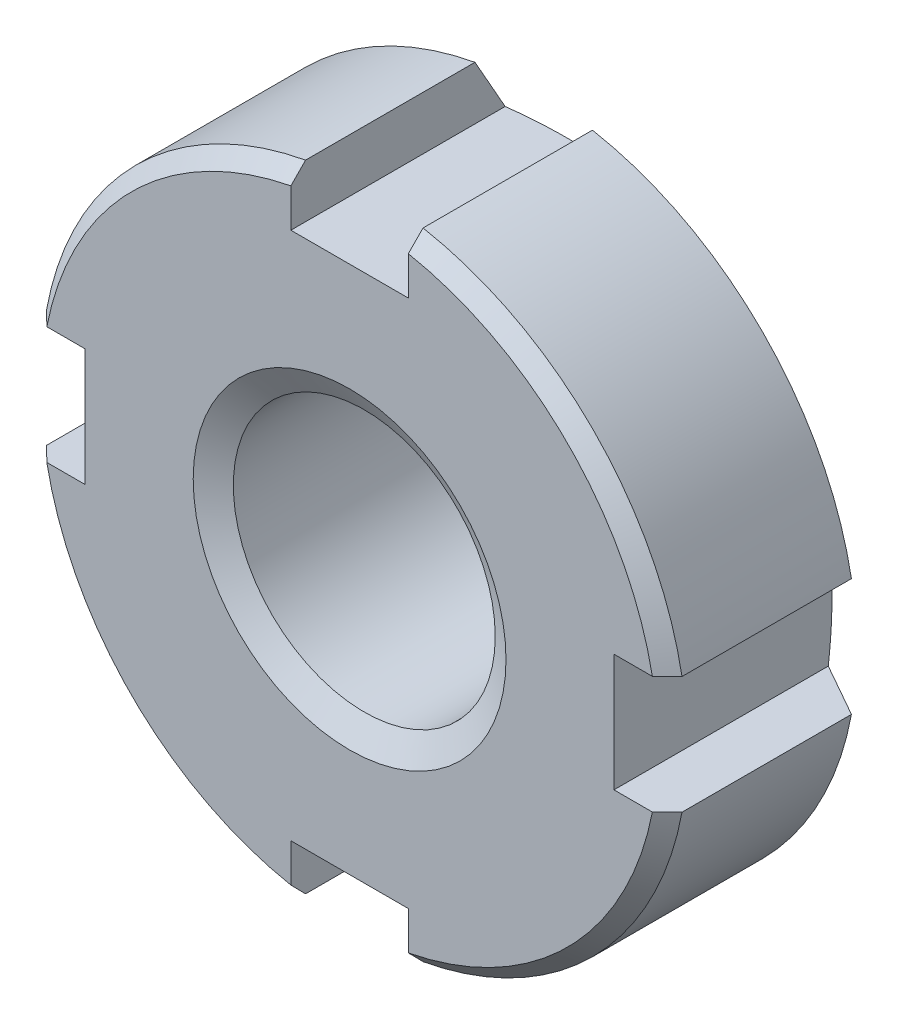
ISO-10303-21;
HEADER;
FILE_DESCRIPTION(('STEP AP214'),'2;1');
FILE_NAME('part.step','',(''),(''),'','','');
FILE_SCHEMA(('AUTOMOTIVE_DESIGN { 1 0 10303 214 1 1 1 1 }'));
ENDSEC;
DATA;
#1=APPLICATION_CONTEXT('core data for automotive mechanical design processes');
#2=APPLICATION_PROTOCOL_DEFINITION('international standard','automotive_design',2000,#1);
#3=PRODUCT_CONTEXT('',#1,'mechanical');
#4=PRODUCT('Part','Part','',(#3));
#5=PRODUCT_RELATED_PRODUCT_CATEGORY('part','',(#4));
#6=PRODUCT_DEFINITION_FORMATION('','',#4);
#7=PRODUCT_DEFINITION_CONTEXT('part definition',#1,'design');
#8=PRODUCT_DEFINITION('design','',#6,#7);
#9=PRODUCT_DEFINITION_SHAPE('','',#8);
#10=(LENGTH_UNIT() NAMED_UNIT(*) SI_UNIT(.MILLI.,.METRE.));
#11=(NAMED_UNIT(*) PLANE_ANGLE_UNIT() SI_UNIT($,.RADIAN.));
#12=(NAMED_UNIT(*) SI_UNIT($,.STERADIAN.) SOLID_ANGLE_UNIT());
#13=UNCERTAINTY_MEASURE_WITH_UNIT(LENGTH_MEASURE(1.E-05),#10,'distance_accuracy_value','');
#14=(GEOMETRIC_REPRESENTATION_CONTEXT(3) GLOBAL_UNCERTAINTY_ASSIGNED_CONTEXT((#13)) GLOBAL_UNIT_ASSIGNED_CONTEXT((#10,
#11,#12)) REPRESENTATION_CONTEXT('',''));
#15=CARTESIAN_POINT('',(0.,0.,0.));
#16=DIRECTION('',(0.,0.,1.));
#17=DIRECTION('',(1.,0.,0.));
#18=AXIS2_PLACEMENT_3D('',#15,#16,#17);
#19=CARTESIAN_POINT('',(0.,0.,-8.));
#20=DIRECTION('',(0.,0.,1.));
#21=DIRECTION('',(1.,0.,0.));
#22=AXIS2_PLACEMENT_3D('',#19,#20,#21);
#23=CYLINDRICAL_SURFACE('',#22,11.);
#24=DIRECTION('',(0.,0.,-1.));
#25=VECTOR('',#24,1.);
#26=CARTESIAN_POINT('',(-10.8166538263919,-2.00000000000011,0.));
#27=LINE('',#26,#25);
#28=CARTESIAN_POINT('',(-10.8166538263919,-2.00000000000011,-0.499999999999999));
#29=VERTEX_POINT('',#28);
#30=CARTESIAN_POINT('',(-10.8166538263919,-2.00000000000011,-6.26794919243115));
#31=VERTEX_POINT('',#30);
#32=EDGE_CURVE('E188',#29,#31,#27,.T.);
#33=ORIENTED_EDGE('',*,*,#32,.T.);
#34=CARTESIAN_POINT('',(0.,0.,-6.26794919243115));
#35=DIRECTION('',(0.,0.,-1.));
#36=DIRECTION('',(-1.,0.,0.));
#37=AXIS2_PLACEMENT_3D('',#34,#35,#36);
#38=CIRCLE('',#37,11.);
#39=CARTESIAN_POINT('',(-2.,-10.816653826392,-6.26794919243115));
#40=VERTEX_POINT('',#39);
#41=EDGE_CURVE('E454',#40,#31,#38,.T.);
#42=ORIENTED_EDGE('',*,*,#41,.F.);
#43=DIRECTION('',(0.,0.,-1.));
#44=VECTOR('',#43,1.);
#45=CARTESIAN_POINT('',(-2.,-10.816653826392,0.));
#46=LINE('',#45,#44);
#47=CARTESIAN_POINT('',(-2.,-10.816653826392,-0.499999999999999));
#48=VERTEX_POINT('',#47);
#49=EDGE_CURVE('E434',#48,#40,#46,.T.);
#50=ORIENTED_EDGE('',*,*,#49,.F.);
#51=CARTESIAN_POINT('',(0.,0.,-0.500000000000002));
#52=DIRECTION('',(0.,0.,1.));
#53=DIRECTION('',(1.,0.,0.));
#54=AXIS2_PLACEMENT_3D('',#51,#52,#53);
#55=CIRCLE('',#54,11.);
#56=EDGE_CURVE('E489',#48,#29,#55,.F.);
#57=ORIENTED_EDGE('',*,*,#56,.T.);
#58=EDGE_LOOP('',(#33,#42,#50,#57));
#59=FACE_BOUND('',#58,.T.);
#60=ADVANCED_FACE('F30',(#59),#23,.T.);
#61=CARTESIAN_POINT('',(0.,0.,0.));
#62=DIRECTION('',(0.,0.,-1.));
#63=DIRECTION('',(-1.,0.,0.));
#64=AXIS2_PLACEMENT_3D('',#61,#62,#63);
#65=CONICAL_SURFACE('',#64,10.5,0.785398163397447);
#66=CARTESIAN_POINT('',(-13.1380677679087,-2.00000000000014,-2.78942529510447));
#67=CARTESIAN_POINT('',(-12.7116462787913,-2.00000000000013,-2.36789004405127));
#68=CARTESIAN_POINT('',(-12.2850202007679,-2.00000000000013,-1.9465611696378));
#69=CARTESIAN_POINT('',(-11.4311341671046,-2.00000000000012,-1.10455061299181));
#70=CARTESIAN_POINT('',(-11.0038742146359,-2.00000000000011,-0.683868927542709));
#71=CARTESIAN_POINT('',(-10.148490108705,-2.0000000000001,0.156618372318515));
#72=CARTESIAN_POINT('',(-9.7203659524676,-2.0000000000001,0.576423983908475));
#73=CARTESIAN_POINT('',(-9.07722771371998,-2.00000000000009,1.20516089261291));
#74=CARTESIAN_POINT('',(-8.86268909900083,-2.00000000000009,1.41457846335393));
#75=CARTESIAN_POINT('',(-8.43321406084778,-2.00000000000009,1.83300575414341));
#76=CARTESIAN_POINT('',(-8.21827763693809,-2.00000000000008,2.04201547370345));
#77=CARTESIAN_POINT('',(-8.00310215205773,-2.00000000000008,2.25077918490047));
#78=B_SPLINE_CURVE_WITH_KNOTS('',3,(#66,#67,#68,#69,#70,#71,#72,#73,#74,#75,#76,#77),
.UNSPECIFIED.,.F.,.F.,(4,2,2,2,2,4),(0.,1.7988182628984,3.59762755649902,5.39644263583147,
6.29585464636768,7.19526773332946),.UNSPECIFIED.);
#79=CARTESIAN_POINT('',(-10.3077640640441,-2.00000000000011,0.));
#80=VERTEX_POINT('',#79);
#81=EDGE_CURVE('E211',#29,#80,#78,.T.);
#82=ORIENTED_EDGE('',*,*,#81,.F.);
#83=ORIENTED_EDGE('',*,*,#56,.F.);
#84=CARTESIAN_POINT('',(-2.,-8.00310215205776,2.25077918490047));
#85=CARTESIAN_POINT('',(-2.,-8.21827763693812,2.04201547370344));
#86=CARTESIAN_POINT('',(-2.,-8.4332140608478,1.8330057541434));
#87=CARTESIAN_POINT('',(-2.,-8.86268909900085,1.41457846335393));
#88=CARTESIAN_POINT('',(-2.,-9.07722771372,1.20516089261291));
#89=CARTESIAN_POINT('',(-2.,-9.72036595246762,0.576423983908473));
#90=CARTESIAN_POINT('',(-2.,-10.1484901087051,0.156618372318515));
#91=CARTESIAN_POINT('',(-2.,-11.003874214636,-0.683868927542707));
#92=CARTESIAN_POINT('',(-2.,-11.4311341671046,-1.1045506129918));
#93=CARTESIAN_POINT('',(-2.,-12.2850202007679,-1.9465611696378));
#94=CARTESIAN_POINT('',(-2.,-12.7116462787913,-2.36789004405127));
#95=CARTESIAN_POINT('',(-2.,-13.1380677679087,-2.78942529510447));
#96=B_SPLINE_CURVE_WITH_KNOTS('',3,(#84,#85,#86,#87,#88,#89,#90,#91,#92,#93,#94,#95),
.UNSPECIFIED.,.F.,.F.,(4,2,2,2,2,4),(0.,0.899413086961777,1.79882509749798,3.59764017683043,
5.39644947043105,7.19526773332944),.UNSPECIFIED.);
#97=CARTESIAN_POINT('',(-2.,-10.3077640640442,0.));
#98=VERTEX_POINT('',#97);
#99=EDGE_CURVE('E402',#98,#48,#96,.T.);
#100=ORIENTED_EDGE('',*,*,#99,.F.);
#101=CARTESIAN_POINT('',(0.,0.,0.));
#102=DIRECTION('',(0.,0.,1.));
#103=DIRECTION('',(1.,0.,0.));
#104=AXIS2_PLACEMENT_3D('',#101,#102,#103);
#105=CIRCLE('',#104,10.5);
#106=EDGE_CURVE('E459',#80,#98,#105,.T.);
#107=ORIENTED_EDGE('',*,*,#106,.F.);
#108=EDGE_LOOP('',(#82,#83,#100,#107));
#109=FACE_BOUND('',#108,.T.);
#110=ADVANCED_FACE('F514',(#109),#65,.T.);
#111=DIRECTION('',(0.,0.,-1.));
#112=VECTOR('',#111,1.);
#113=CARTESIAN_POINT('',(-10.816653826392,1.99999999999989,0.));
#114=LINE('',#113,#112);
#115=CARTESIAN_POINT('',(-10.816653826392,1.99999999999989,-0.499999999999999));
#116=VERTEX_POINT('',#115);
#117=CARTESIAN_POINT('',(-10.816653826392,1.99999999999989,-6.26794919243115));
#118=VERTEX_POINT('',#117);
#119=EDGE_CURVE('E50',#116,#118,#114,.T.);
#120=ORIENTED_EDGE('',*,*,#119,.F.);
#121=CARTESIAN_POINT('',(-2.00000000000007,10.816653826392,-0.499999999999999));
#122=VERTEX_POINT('',#121);
#123=EDGE_CURVE('E472',#116,#122,#55,.F.);
#124=ORIENTED_EDGE('',*,*,#123,.T.);
#125=DIRECTION('',(0.,0.,-1.));
#126=VECTOR('',#125,1.);
#127=CARTESIAN_POINT('',(-2.00000000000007,10.816653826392,0.));
#128=LINE('',#127,#126);
#129=CARTESIAN_POINT('',(-2.00000000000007,10.816653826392,-6.26794919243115));
#130=VERTEX_POINT('',#129);
#131=EDGE_CURVE('E334',#122,#130,#128,.T.);
#132=ORIENTED_EDGE('',*,*,#131,.T.);
#133=EDGE_CURVE('E455',#118,#130,#38,.T.);
#134=ORIENTED_EDGE('',*,*,#133,.F.);
#135=EDGE_LOOP('',(#120,#124,#132,#134));
#136=FACE_BOUND('',#135,.T.);
#137=ADVANCED_FACE('F470',(#136),#23,.T.);
#138=CARTESIAN_POINT('',(-8.00310215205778,1.99999999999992,2.25077918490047));
#139=CARTESIAN_POINT('',(-8.21827763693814,1.99999999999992,2.04201547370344));
#140=CARTESIAN_POINT('',(-8.43321406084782,1.99999999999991,1.8330057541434));
#141=CARTESIAN_POINT('',(-8.86268909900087,1.99999999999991,1.41457846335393));
#142=CARTESIAN_POINT('',(-9.07722771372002,1.99999999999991,1.20516089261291));
#143=CARTESIAN_POINT('',(-9.72036595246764,1.9999999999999,0.576423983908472));
#144=CARTESIAN_POINT('',(-10.1484901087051,1.9999999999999,0.156618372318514));
#145=CARTESIAN_POINT('',(-11.003874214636,1.99999999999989,-0.683868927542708));
#146=CARTESIAN_POINT('',(-11.4311341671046,1.99999999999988,-1.10455061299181));
#147=CARTESIAN_POINT('',(-12.2850202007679,1.99999999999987,-1.9465611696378));
#148=CARTESIAN_POINT('',(-12.7116462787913,1.99999999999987,-2.36789004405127));
#149=CARTESIAN_POINT('',(-13.1380677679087,1.99999999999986,-2.78942529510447));
#150=B_SPLINE_CURVE_WITH_KNOTS('',3,(#138,#139,#140,#141,#142,#143,#144,#145,#146,#147,#148,
#149),.UNSPECIFIED.,.F.,.F.,(4,2,2,2,2,4),(0.,0.899413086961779,1.79882509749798,
3.59764017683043,5.39644947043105,7.19526773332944),.UNSPECIFIED.);
#151=CARTESIAN_POINT('',(-10.3077640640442,1.99999999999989,0.));
#152=VERTEX_POINT('',#151);
#153=EDGE_CURVE('E200',#152,#116,#150,.T.);
#154=ORIENTED_EDGE('',*,*,#153,.F.);
#155=CARTESIAN_POINT('',(-2.00000000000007,10.3077640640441,0.));
#156=VERTEX_POINT('',#155);
#157=EDGE_CURVE('E195',#156,#152,#105,.T.);
#158=ORIENTED_EDGE('',*,*,#157,.F.);
#159=CARTESIAN_POINT('',(-2.00000000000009,12.9075072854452,-2.56153682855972));
#160=CARTESIAN_POINT('',(-2.00000000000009,12.4809980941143,-2.14008985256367));
#161=CARTESIAN_POINT('',(-2.00000000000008,12.0542746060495,-1.71885908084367));
#162=CARTESIAN_POINT('',(-2.00000000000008,11.2001558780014,-0.877084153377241));
#163=CARTESIAN_POINT('',(-2.00000000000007,10.7727606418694,-0.456539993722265));
#164=CARTESIAN_POINT('',(-2.00000000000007,9.91704878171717,0.383613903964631));
#165=CARTESIAN_POINT('',(-2.00000000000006,9.48873215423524,0.803223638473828));
#166=CARTESIAN_POINT('',(-2.00000000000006,8.8452332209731,1.4315922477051));
#167=CARTESIAN_POINT('',(-2.00000000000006,8.63056229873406,1.64087471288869));
#168=CARTESIAN_POINT('',(-2.00000000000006,8.20078989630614,2.05899763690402));
#169=CARTESIAN_POINT('',(-2.00000000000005,7.98568841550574,2.26783809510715));
#170=CARTESIAN_POINT('',(-2.00000000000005,7.77032714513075,2.47641078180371));
#171=B_SPLINE_CURVE_WITH_KNOTS('',3,(#159,#160,#161,#162,#163,#164,#165,#166,#167,#168,#169,
#170),.UNSPECIFIED.,.F.,.F.,(4,2,2,2,2,4),(0.,1.79881931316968,3.59762835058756,
5.39644415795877,6.295857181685,7.19527148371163),.UNSPECIFIED.);
#172=EDGE_CURVE('E332',#122,#156,#171,.T.);
#173=ORIENTED_EDGE('',*,*,#172,.F.);
#174=ORIENTED_EDGE('',*,*,#123,.F.);
#175=EDGE_LOOP('',(#154,#158,#173,#174));
#176=FACE_BOUND('',#175,.T.);
#177=ADVANCED_FACE('F520',(#176),#65,.T.);
#178=DIRECTION('',(0.,0.,-1.));
#179=VECTOR('',#178,1.);
#180=CARTESIAN_POINT('',(1.99999999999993,10.816653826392,0.));
#181=LINE('',#180,#179);
#182=CARTESIAN_POINT('',(1.99999999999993,10.816653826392,-0.499999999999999));
#183=VERTEX_POINT('',#182);
#184=CARTESIAN_POINT('',(1.99999999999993,10.816653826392,-6.26794919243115));
#185=VERTEX_POINT('',#184);
#186=EDGE_CURVE('E58',#183,#185,#181,.T.);
#187=ORIENTED_EDGE('',*,*,#186,.F.);
#188=CARTESIAN_POINT('',(10.816653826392,2.00000000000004,-0.499999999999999));
#189=VERTEX_POINT('',#188);
#190=EDGE_CURVE('E364',#183,#189,#55,.F.);
#191=ORIENTED_EDGE('',*,*,#190,.T.);
#192=DIRECTION('',(0.,0.,-1.));
#193=VECTOR('',#192,1.);
#194=CARTESIAN_POINT('',(10.816653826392,2.00000000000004,0.));
#195=LINE('',#194,#193);
#196=CARTESIAN_POINT('',(10.816653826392,2.00000000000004,-6.26794919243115));
#197=VERTEX_POINT('',#196);
#198=EDGE_CURVE('E349',#189,#197,#195,.T.);
#199=ORIENTED_EDGE('',*,*,#198,.T.);
#200=EDGE_CURVE('E362',#185,#197,#38,.T.);
#201=ORIENTED_EDGE('',*,*,#200,.F.);
#202=EDGE_LOOP('',(#187,#191,#199,#201));
#203=FACE_BOUND('',#202,.T.);
#204=ADVANCED_FACE('F361',(#203),#23,.T.);
#205=CARTESIAN_POINT('',(1.99999999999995,7.77032714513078,2.4764107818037));
#206=CARTESIAN_POINT('',(1.99999999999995,7.98568841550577,2.26783809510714));
#207=CARTESIAN_POINT('',(1.99999999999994,8.20078989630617,2.05899763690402));
#208=CARTESIAN_POINT('',(1.99999999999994,8.6305622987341,1.64087471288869));
#209=CARTESIAN_POINT('',(1.99999999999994,8.84523322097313,1.4315922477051));
#210=CARTESIAN_POINT('',(1.99999999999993,9.48873215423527,0.803223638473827));
#211=CARTESIAN_POINT('',(1.99999999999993,9.91704878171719,0.383613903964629));
#212=CARTESIAN_POINT('',(1.99999999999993,10.7727606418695,-0.456539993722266));
#213=CARTESIAN_POINT('',(1.99999999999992,11.2001558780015,-0.877084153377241));
#214=CARTESIAN_POINT('',(1.99999999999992,12.0542746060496,-1.71885908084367));
#215=CARTESIAN_POINT('',(1.99999999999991,12.4809980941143,-2.14008985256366));
#216=CARTESIAN_POINT('',(1.99999999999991,12.9075072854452,-2.56153682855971));
#217=B_SPLINE_CURVE_WITH_KNOTS('',3,(#205,#206,#207,#208,#209,#210,#211,#212,#213,#214,#215,
#216),.UNSPECIFIED.,.F.,.F.,(4,2,2,2,2,4),(0.,0.899414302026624,1.79882732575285,
3.59764313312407,5.39645217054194,7.19527148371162),.UNSPECIFIED.);
#218=CARTESIAN_POINT('',(1.99999999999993,10.3077640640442,0.));
#219=VERTEX_POINT('',#218);
#220=EDGE_CURVE('E326',#219,#183,#217,.T.);
#221=ORIENTED_EDGE('',*,*,#220,.F.);
#222=CARTESIAN_POINT('',(10.3077640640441,2.00000000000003,0.));
#223=VERTEX_POINT('',#222);
#224=EDGE_CURVE('E377',#223,#219,#105,.T.);
#225=ORIENTED_EDGE('',*,*,#224,.F.);
#226=CARTESIAN_POINT('',(12.9075072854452,2.00000000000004,-2.56153682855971));
#227=CARTESIAN_POINT('',(12.4809980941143,2.00000000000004,-2.14008985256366));
#228=CARTESIAN_POINT('',(12.0542746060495,2.00000000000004,-1.71885908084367));
#229=CARTESIAN_POINT('',(11.2001558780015,2.00000000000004,-0.877084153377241));
#230=CARTESIAN_POINT('',(10.7727606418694,2.00000000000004,-0.456539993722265));
#231=CARTESIAN_POINT('',(9.91704878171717,2.00000000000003,0.383613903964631));
#232=CARTESIAN_POINT('',(9.48873215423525,2.00000000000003,0.803223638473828));
#233=CARTESIAN_POINT('',(8.84523322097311,2.00000000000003,1.4315922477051));
#234=CARTESIAN_POINT('',(8.63056229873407,2.00000000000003,1.64087471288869));
#235=CARTESIAN_POINT('',(8.20078989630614,2.00000000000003,2.05899763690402));
#236=CARTESIAN_POINT('',(7.98568841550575,2.00000000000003,2.26783809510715));
#237=CARTESIAN_POINT('',(7.77032714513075,2.00000000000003,2.47641078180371));
#238=B_SPLINE_CURVE_WITH_KNOTS('',3,(#226,#227,#228,#229,#230,#231,#232,#233,#234,#235,#236,
#237),.UNSPECIFIED.,.F.,.F.,(4,2,2,2,2,4),(0.,1.79881931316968,3.59762835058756,
5.39644415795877,6.295857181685,7.19527148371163),.UNSPECIFIED.);
#239=EDGE_CURVE('E370',#189,#223,#238,.T.);
#240=ORIENTED_EDGE('',*,*,#239,.F.);
#241=ORIENTED_EDGE('',*,*,#190,.F.);
#242=EDGE_LOOP('',(#221,#225,#240,#241));
#243=FACE_BOUND('',#242,.T.);
#244=ADVANCED_FACE('F375',(#243),#65,.T.);
#245=DIRECTION('',(0.,0.,-1.));
#246=VECTOR('',#245,1.);
#247=CARTESIAN_POINT('',(10.816653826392,-1.99999999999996,0.));
#248=LINE('',#247,#246);
#249=CARTESIAN_POINT('',(10.816653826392,-1.99999999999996,-0.499999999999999));
#250=VERTEX_POINT('',#249);
#251=CARTESIAN_POINT('',(10.816653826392,-1.99999999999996,-6.26794919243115));
#252=VERTEX_POINT('',#251);
#253=EDGE_CURVE('E356',#250,#252,#248,.T.);
#254=ORIENTED_EDGE('',*,*,#253,.F.);
#255=CARTESIAN_POINT('',(2.,-10.816653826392,-0.499999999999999));
#256=VERTEX_POINT('',#255);
#257=EDGE_CURVE('E487',#250,#256,#55,.F.);
#258=ORIENTED_EDGE('',*,*,#257,.T.);
#259=DIRECTION('',(0.,0.,-1.));
#260=VECTOR('',#259,1.);
#261=CARTESIAN_POINT('',(2.,-10.816653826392,0.));
#262=LINE('',#261,#260);
#263=CARTESIAN_POINT('',(2.,-10.816653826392,-6.26794919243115));
#264=VERTEX_POINT('',#263);
#265=EDGE_CURVE('E440',#256,#264,#262,.T.);
#266=ORIENTED_EDGE('',*,*,#265,.T.);
#267=EDGE_CURVE('E449',#252,#264,#38,.T.);
#268=ORIENTED_EDGE('',*,*,#267,.F.);
#269=EDGE_LOOP('',(#254,#258,#266,#268));
#270=FACE_BOUND('',#269,.T.);
#271=ADVANCED_FACE('F452',(#270),#23,.T.);
#272=CARTESIAN_POINT('',(0.,0.,-8.));
#273=DIRECTION('',(0.,0.,1.));
#274=DIRECTION('',(1.,0.,0.));
#275=AXIS2_PLACEMENT_3D('',#272,#273,#274);
#276=PLANE('',#275);
#277=CARTESIAN_POINT('',(0.,0.,-8.));
#278=DIRECTION('',(0.,0.,1.));
#279=DIRECTION('',(1.,0.,0.));
#280=AXIS2_PLACEMENT_3D('',#277,#278,#279);
#281=CIRCLE('',#280,5.1585);
#282=CARTESIAN_POINT('',(5.1585,0.,-8.));
#283=VERTEX_POINT('',#282);
#284=EDGE_CURVE('E497',#283,#283,#281,.T.);
#285=ORIENTED_EDGE('',*,*,#284,.T.);
#286=EDGE_LOOP('',(#285));
#287=FACE_BOUND('',#286,.T.);
#288=CARTESIAN_POINT('',(0.,0.,-8.));
#289=DIRECTION('',(0.,0.,-1.));
#290=DIRECTION('',(-1.,0.,0.));
#291=AXIS2_PLACEMENT_3D('',#288,#289,#290);
#292=CIRCLE('',#291,8.);
#293=CARTESIAN_POINT('',(-8.,0.,-8.));
#294=VERTEX_POINT('',#293);
#295=EDGE_CURVE('E457',#294,#294,#292,.T.);
#296=ORIENTED_EDGE('',*,*,#295,.T.);
#297=EDGE_LOOP('',(#296));
#298=FACE_BOUND('',#297,.T.);
#299=ADVANCED_FACE('F524',(#287,#298),#276,.F.);
#300=CARTESIAN_POINT('',(0.,0.,0.));
#301=DIRECTION('',(0.,0.,1.));
#302=DIRECTION('',(1.,0.,0.));
#303=AXIS2_PLACEMENT_3D('',#300,#301,#302);
#304=PLANE('',#303);
#305=DIRECTION('',(-1.,0.,0.));
#306=VECTOR('',#305,1.);
#307=CARTESIAN_POINT('',(-10.8166538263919,-2.00000000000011,0.));
#308=LINE('',#307,#306);
#309=CARTESIAN_POINT('',(-8.99999999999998,-2.00000000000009,0.));
#310=VERTEX_POINT('',#309);
#311=EDGE_CURVE('E196',#310,#80,#308,.T.);
#312=ORIENTED_EDGE('',*,*,#311,.T.);
#313=ORIENTED_EDGE('',*,*,#106,.T.);
#314=DIRECTION('',(0.,1.,0.));
#315=VECTOR('',#314,1.);
#316=CARTESIAN_POINT('',(-2.,-9.,0.));
#317=LINE('',#316,#315);
#318=CARTESIAN_POINT('',(-2.,-9.,0.));
#319=VERTEX_POINT('',#318);
#320=EDGE_CURVE('E443',#98,#319,#317,.T.);
#321=ORIENTED_EDGE('',*,*,#320,.T.);
#322=DIRECTION('',(1.,0.,0.));
#323=VECTOR('',#322,1.);
#324=CARTESIAN_POINT('',(2.,-9.,0.));
#325=LINE('',#324,#323);
#326=CARTESIAN_POINT('',(2.,-9.,0.));
#327=VERTEX_POINT('',#326);
#328=EDGE_CURVE('E437',#319,#327,#325,.T.);
#329=ORIENTED_EDGE('',*,*,#328,.T.);
#330=DIRECTION('',(0.,-1.,0.));
#331=VECTOR('',#330,1.);
#332=CARTESIAN_POINT('',(2.,-10.816653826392,0.));
#333=LINE('',#332,#331);
#334=CARTESIAN_POINT('',(2.,-10.3077640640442,0.));
#335=VERTEX_POINT('',#334);
#336=EDGE_CURVE('E431',#327,#335,#333,.T.);
#337=ORIENTED_EDGE('',*,*,#336,.T.);
#338=CARTESIAN_POINT('',(10.3077640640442,-1.99999999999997,0.));
#339=VERTEX_POINT('',#338);
#340=EDGE_CURVE('E485',#335,#339,#105,.T.);
#341=ORIENTED_EDGE('',*,*,#340,.T.);
#342=DIRECTION('',(-1.,0.,0.));
#343=VECTOR('',#342,1.);
#344=CARTESIAN_POINT('',(9.,-1.99999999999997,0.));
#345=LINE('',#344,#343);
#346=CARTESIAN_POINT('',(9.,-1.99999999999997,0.));
#347=VERTEX_POINT('',#346);
#348=EDGE_CURVE('E343',#339,#347,#345,.T.);
#349=ORIENTED_EDGE('',*,*,#348,.T.);
#350=DIRECTION('',(0.,1.,0.));
#351=VECTOR('',#350,1.);
#352=CARTESIAN_POINT('',(8.99999999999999,2.00000000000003,0.));
#353=LINE('',#352,#351);
#354=CARTESIAN_POINT('',(8.99999999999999,2.00000000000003,0.));
#355=VERTEX_POINT('',#354);
#356=EDGE_CURVE('E346',#347,#355,#353,.T.);
#357=ORIENTED_EDGE('',*,*,#356,.T.);
#358=DIRECTION('',(1.,0.,0.));
#359=VECTOR('',#358,1.);
#360=CARTESIAN_POINT('',(10.816653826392,2.00000000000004,0.));
#361=LINE('',#360,#359);
#362=EDGE_CURVE('E340',#355,#223,#361,.T.);
#363=ORIENTED_EDGE('',*,*,#362,.T.);
#364=ORIENTED_EDGE('',*,*,#224,.T.);
#365=DIRECTION('',(0.,-1.,0.));
#366=VECTOR('',#365,1.);
#367=CARTESIAN_POINT('',(1.99999999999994,9.00000000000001,0.));
#368=LINE('',#367,#366);
#369=CARTESIAN_POINT('',(1.99999999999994,9.00000000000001,0.));
#370=VERTEX_POINT('',#369);
#371=EDGE_CURVE('E476',#219,#370,#368,.T.);
#372=ORIENTED_EDGE('',*,*,#371,.T.);
#373=DIRECTION('',(-1.,0.,0.));
#374=VECTOR('',#373,1.);
#375=CARTESIAN_POINT('',(-2.00000000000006,8.99999999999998,0.));
#376=LINE('',#375,#374);
#377=CARTESIAN_POINT('',(-2.00000000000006,8.99999999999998,0.));
#378=VERTEX_POINT('',#377);
#379=EDGE_CURVE('E473',#370,#378,#376,.T.);
#380=ORIENTED_EDGE('',*,*,#379,.T.);
#381=DIRECTION('',(0.,1.,0.));
#382=VECTOR('',#381,1.);
#383=CARTESIAN_POINT('',(-2.00000000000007,10.816653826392,0.));
#384=LINE('',#383,#382);
#385=EDGE_CURVE('E480',#378,#156,#384,.T.);
#386=ORIENTED_EDGE('',*,*,#385,.T.);
#387=ORIENTED_EDGE('',*,*,#157,.T.);
#388=DIRECTION('',(1.,0.,0.));
#389=VECTOR('',#388,1.);
#390=CARTESIAN_POINT('',(-9.00000000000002,1.99999999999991,0.));
#391=LINE('',#390,#389);
#392=CARTESIAN_POINT('',(-9.00000000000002,1.99999999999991,0.));
#393=VERTEX_POINT('',#392);
#394=EDGE_CURVE('E174',#152,#393,#391,.T.);
#395=ORIENTED_EDGE('',*,*,#394,.T.);
#396=DIRECTION('',(0.,-1.,0.));
#397=VECTOR('',#396,1.);
#398=CARTESIAN_POINT('',(-8.99999999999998,-2.00000000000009,0.));
#399=LINE('',#398,#397);
#400=EDGE_CURVE('E182',#393,#310,#399,.T.);
#401=ORIENTED_EDGE('',*,*,#400,.T.);
#402=EDGE_LOOP('',(#312,#313,#321,#329,#337,#341,#349,#357,#363,#364,#372,#380,#386,#387,#395,#401));
#403=FACE_BOUND('',#402,.T.);
#404=CARTESIAN_POINT('',(0.,0.,0.));
#405=DIRECTION('',(0.,0.,1.));
#406=DIRECTION('',(1.,0.,0.));
#407=AXIS2_PLACEMENT_3D('',#404,#405,#406);
#408=CIRCLE('',#407,5.32452540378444);
#409=CARTESIAN_POINT('',(5.32452540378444,0.,0.));
#410=VERTEX_POINT('',#409);
#411=EDGE_CURVE('E495',#410,#410,#408,.F.);
#412=ORIENTED_EDGE('',*,*,#411,.T.);
#413=EDGE_LOOP('',(#412));
#414=FACE_BOUND('',#413,.T.);
#415=ADVANCED_FACE('F191',(#403,#414),#304,.T.);
#416=CARTESIAN_POINT('',(0.,0.,-8.));
#417=DIRECTION('',(0.,0.,1.));
#418=DIRECTION('',(1.,0.,0.));
#419=AXIS2_PLACEMENT_3D('',#416,#417,#418);
#420=CYLINDRICAL_SURFACE('',#419,4.4585);
#421=CARTESIAN_POINT('',(0.,0.,-7.3));
#422=DIRECTION('',(0.,0.,1.));
#423=DIRECTION('',(1.,0.,0.));
#424=AXIS2_PLACEMENT_3D('',#421,#422,#423);
#425=CIRCLE('',#424,4.4585);
#426=CARTESIAN_POINT('',(4.4585,0.,-7.3));
#427=VERTEX_POINT('',#426);
#428=EDGE_CURVE('E408',#427,#427,#425,.F.);
#429=ORIENTED_EDGE('',*,*,#428,.T.);
#430=EDGE_LOOP('',(#429));
#431=FACE_BOUND('',#430,.T.);
#432=CARTESIAN_POINT('',(0.,0.,-0.5));
#433=DIRECTION('',(0.,0.,1.));
#434=DIRECTION('',(1.,0.,0.));
#435=AXIS2_PLACEMENT_3D('',#432,#433,#434);
#436=CIRCLE('',#435,4.4585);
#437=CARTESIAN_POINT('',(4.4585,0.,-0.5));
#438=VERTEX_POINT('',#437);
#439=EDGE_CURVE('E492',#438,#438,#436,.T.);
#440=ORIENTED_EDGE('',*,*,#439,.T.);
#441=EDGE_LOOP('',(#440));
#442=FACE_BOUND('',#441,.T.);
#443=ADVANCED_FACE('F246',(#431,#442),#420,.F.);
#444=CARTESIAN_POINT('',(0.,0.,-6.26794919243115));
#445=DIRECTION('',(0.,0.,1.));
#446=DIRECTION('',(1.,0.,0.));
#447=AXIS2_PLACEMENT_3D('',#444,#445,#446);
#448=CONICAL_SURFACE('',#447,11.,1.0471975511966);
#449=ORIENTED_EDGE('',*,*,#295,.F.);
#450=EDGE_LOOP('',(#449));
#451=FACE_BOUND('',#450,.T.);
#452=ORIENTED_EDGE('',*,*,#41,.T.);
#453=CARTESIAN_POINT('',(-14.5180397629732,-2.00000000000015,-4.15764623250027));
#454=CARTESIAN_POINT('',(-14.1878135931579,-2.00000000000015,-4.34651765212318));
#455=CARTESIAN_POINT('',(-13.857536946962,-2.00000000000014,-4.53530074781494));
#456=CARTESIAN_POINT('',(-13.1968554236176,-2.00000000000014,-4.91264294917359));
#457=CARTESIAN_POINT('',(-12.866450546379,-2.00000000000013,-5.10120205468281));
#458=CARTESIAN_POINT('',(-11.8750106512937,-2.00000000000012,-5.66646781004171));
#459=CARTESIAN_POINT('',(-11.2137430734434,-2.00000000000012,-6.04276707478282));
#460=CARTESIAN_POINT('',(-10.2210665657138,-2.00000000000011,-6.60585872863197));
#461=CARTESIAN_POINT('',(-9.8900432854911,-2.0000000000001,-6.79333082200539));
#462=CARTESIAN_POINT('',(-9.22764882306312,-2.0000000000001,-7.16765827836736));
#463=CARTESIAN_POINT('',(-8.8962776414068,-2.00000000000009,-7.35451364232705));
#464=CARTESIAN_POINT('',(-8.23306446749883,-2.00000000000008,-7.72739667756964));
#465=CARTESIAN_POINT('',(-7.9012224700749,-2.00000000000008,-7.91342433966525));
#466=CARTESIAN_POINT('',(-7.23684820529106,-2.00000000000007,-8.28424663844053));
#467=CARTESIAN_POINT('',(-6.90431593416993,-2.00000000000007,-8.46904126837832));
#468=CARTESIAN_POINT('',(-6.57132877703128,-2.00000000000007,-8.65301673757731));
#469=B_SPLINE_CURVE_WITH_KNOTS('',3,(#453,#454,#455,#456,#457,#458,#459,#460,#461,#462,#463,
#464,#465,#466,#467,#468),.UNSPECIFIED.,.F.,.F.,(4,2,2,2,2,2,2,4),(0.,1.14126920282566,
2.28253920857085,4.56505399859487,5.7063246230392,6.8475934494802,7.98887491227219,
9.13016261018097),.UNSPECIFIED.);
#470=CARTESIAN_POINT('',(-8.99999999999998,-2.00000000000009,-7.29589567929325));
#471=VERTEX_POINT('',#470);
#472=EDGE_CURVE('E11',#31,#471,#469,.T.);
#473=ORIENTED_EDGE('',*,*,#472,.T.);
#474=CARTESIAN_POINT('',(-8.99999999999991,-8.55419893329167,-5.45001984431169));
#475=CARTESIAN_POINT('',(-8.99999999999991,-8.26811578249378,-5.56377412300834));
#476=CARTESIAN_POINT('',(-8.99999999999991,-7.9810073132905,-5.6750070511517));
#477=CARTESIAN_POINT('',(-8.99999999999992,-7.40438644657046,-5.89133370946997));
#478=CARTESIAN_POINT('',(-8.99999999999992,-7.11487330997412,-5.99642546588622));
#479=CARTESIAN_POINT('',(-8.99999999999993,-6.53179842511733,-6.19981325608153));
#480=CARTESIAN_POINT('',(-8.99999999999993,-6.23822359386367,-6.29807214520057));
#481=CARTESIAN_POINT('',(-8.99999999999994,-5.64831476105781,-6.48575369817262));
#482=CARTESIAN_POINT('',(-8.99999999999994,-5.35198099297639,-6.57517710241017));
#483=CARTESIAN_POINT('',(-8.99999999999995,-4.46879431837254,-6.82484752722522));
#484=CARTESIAN_POINT('',(-8.99999999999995,-3.87748484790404,-6.97018736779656));
#485=CARTESIAN_POINT('',(-8.99999999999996,-2.9830200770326,-7.1470513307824));
#486=CARTESIAN_POINT('',(-8.99999999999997,-2.68387585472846,-7.19912117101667));
#487=CARTESIAN_POINT('',(-8.99999999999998,-2.08330390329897,-7.28788620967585));
#488=CARTESIAN_POINT('',(-8.99999999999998,-1.78187650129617,-7.32458356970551));
#489=CARTESIAN_POINT('',(-8.99999999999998,-1.27413100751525,-7.37214566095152));
#490=CARTESIAN_POINT('',(-8.99999999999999,-1.06822679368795,-7.38751860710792));
#491=CARTESIAN_POINT('',(-8.99999999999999,-0.655977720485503,-7.41021211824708));
#492=CARTESIAN_POINT('',(-8.99999999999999,-0.449632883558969,-7.41753308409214));
#493=CARTESIAN_POINT('',(-9.,-0.036764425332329,-7.42397287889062));
#494=CARTESIAN_POINT('',(-9.,0.169759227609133,-7.42308967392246));
#495=CARTESIAN_POINT('',(-9.,0.582610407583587,-7.41313555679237));
#496=CARTESIAN_POINT('',(-9.00000000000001,0.788937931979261,-7.40406453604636));
#497=CARTESIAN_POINT('',(-9.00000000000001,1.20192608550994,-7.37786286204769));
#498=CARTESIAN_POINT('',(-9.00000000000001,1.40858462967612,-7.36069942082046));
#499=CARTESIAN_POINT('',(-9.00000000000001,1.82111619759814,-7.31863849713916));
#500=CARTESIAN_POINT('',(-9.00000000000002,2.02698916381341,-7.29374045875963));
#501=CARTESIAN_POINT('',(-9.00000000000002,2.64301380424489,-7.20810672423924));
#502=CARTESIAN_POINT('',(-9.00000000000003,3.05167696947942,-7.1364242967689));
#503=CARTESIAN_POINT('',(-9.00000000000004,3.81904073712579,-6.9775550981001));
#504=CARTESIAN_POINT('',(-9.00000000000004,4.17829071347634,-6.89294247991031));
#505=CARTESIAN_POINT('',(-9.00000000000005,4.89256535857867,-6.70735930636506));
#506=CARTESIAN_POINT('',(-9.00000000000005,5.24758940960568,-6.60638639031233));
#507=CARTESIAN_POINT('',(-9.00000000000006,5.9541329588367,-6.39086683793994));
#508=CARTESIAN_POINT('',(-9.00000000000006,6.3056452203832,-6.27629671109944));
#509=CARTESIAN_POINT('',(-9.00000000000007,7.00488039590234,-6.03626611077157));
#510=CARTESIAN_POINT('',(-9.00000000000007,7.35260356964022,-5.91080638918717));
#511=CARTESIAN_POINT('',(-9.00000000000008,8.04280198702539,-5.65177798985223));
#512=CARTESIAN_POINT('',(-9.00000000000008,8.38529563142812,-5.51825808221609));
#513=CARTESIAN_POINT('',(-9.00000000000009,9.06743318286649,-5.24410594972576));
#514=CARTESIAN_POINT('',(-9.00000000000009,9.40707695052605,-5.10347337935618));
#515=CARTESIAN_POINT('',(-9.0000000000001,10.0823328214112,-4.81706970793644));
#516=CARTESIAN_POINT('',(-9.0000000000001,10.4179562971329,-4.67132531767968));
#517=CARTESIAN_POINT('',(-9.00000000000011,11.0870298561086,-4.37508355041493));
#518=CARTESIAN_POINT('',(-9.00000000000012,11.420480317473,-4.22458702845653));
#519=CARTESIAN_POINT('',(-9.00000000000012,11.7530410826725,-4.07218538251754));
#520=B_SPLINE_CURVE_WITH_KNOTS('',3,(#474,#475,#476,#477,#478,#479,#480,#481,#482,#483,#484,
#485,#486,#487,#488,#489,#490,#491,#492,#493,#494,#495,#496,#497,#498,#499,#500,#501,#502,#503,
#504,#505,#506,#507,#508,#509,#510,#511,#512,#513,#514,#515,#516,#517,#518,#519),.UNSPECIFIED.,
.F.,.F.,(4,2,2,2,2,2,2,2,2,2,2,2,2,2,2,2,2,2,2,2,2,2,4),(0.,0.923625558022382,1.84754635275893,
2.77615012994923,3.70467602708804,5.52903466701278,6.43964717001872,7.35013158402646,
7.96942220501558,8.58868199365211,9.20809530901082,9.82751683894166,10.4494699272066,
11.0714677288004,12.3151461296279,13.4219675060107,14.5289487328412,15.6378710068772,
16.7467167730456,17.849420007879,18.9521768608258,20.0498442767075,21.1473153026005),.UNSPECIFIED.);
#521=CARTESIAN_POINT('',(-9.00000000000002,1.99999999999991,-7.29589567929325));
#522=VERTEX_POINT('',#521);
#523=EDGE_CURVE('E43',#471,#522,#520,.T.);
#524=ORIENTED_EDGE('',*,*,#523,.T.);
#525=CARTESIAN_POINT('',(-6.57132877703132,1.99999999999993,-8.65301673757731));
#526=CARTESIAN_POINT('',(-6.90431593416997,1.99999999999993,-8.46904126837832));
#527=CARTESIAN_POINT('',(-7.2368482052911,1.99999999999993,-8.28424663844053));
#528=CARTESIAN_POINT('',(-7.90122247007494,1.99999999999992,-7.91342433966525));
#529=CARTESIAN_POINT('',(-8.23306446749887,1.99999999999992,-7.72739667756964));
#530=CARTESIAN_POINT('',(-8.89627764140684,1.99999999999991,-7.35451364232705));
#531=CARTESIAN_POINT('',(-9.22764882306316,1.9999999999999,-7.16765827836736));
#532=CARTESIAN_POINT('',(-9.89004328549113,1.9999999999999,-6.7933308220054));
#533=CARTESIAN_POINT('',(-10.2210665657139,1.99999999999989,-6.60585872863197));
#534=CARTESIAN_POINT('',(-11.2137430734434,1.99999999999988,-6.04276707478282));
#535=CARTESIAN_POINT('',(-11.8750106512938,1.99999999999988,-5.66646781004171));
#536=CARTESIAN_POINT('',(-12.866450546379,1.99999999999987,-5.10120205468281));
#537=CARTESIAN_POINT('',(-13.1968554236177,1.99999999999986,-4.91264294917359));
#538=CARTESIAN_POINT('',(-13.8575369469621,1.99999999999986,-4.53530074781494));
#539=CARTESIAN_POINT('',(-14.187813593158,1.99999999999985,-4.34651765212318));
#540=CARTESIAN_POINT('',(-14.5180397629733,1.99999999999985,-4.15764623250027));
#541=B_SPLINE_CURVE_WITH_KNOTS('',3,(#525,#526,#527,#528,#529,#530,#531,#532,#533,#534,#535,
#536,#537,#538,#539,#540),.UNSPECIFIED.,.F.,.F.,(4,2,2,2,2,2,2,4),(0.,1.14128769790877,
2.28256916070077,3.42383798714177,4.5651086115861,6.84762340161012,7.9888934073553,
9.13016261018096),.UNSPECIFIED.);
#542=EDGE_CURVE('E176',#522,#118,#541,.T.);
#543=ORIENTED_EDGE('',*,*,#542,.T.);
#544=ORIENTED_EDGE('',*,*,#133,.T.);
#545=CARTESIAN_POINT('',(-2.00000000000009,13.1183891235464,-4.95738076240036));
#546=CARTESIAN_POINT('',(-2.00000000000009,12.7879875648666,-5.14595360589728));
#547=CARTESIAN_POINT('',(-2.00000000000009,12.4575208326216,-5.3344124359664));
#548=CARTESIAN_POINT('',(-2.00000000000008,11.7964107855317,-5.71102033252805));
#549=CARTESIAN_POINT('',(-2.00000000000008,11.4657674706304,-5.89916939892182));
#550=CARTESIAN_POINT('',(-2.00000000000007,10.8042674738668,-6.27507066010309));
#551=CARTESIAN_POINT('',(-2.00000000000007,10.4734107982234,-6.46282286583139));
#552=CARTESIAN_POINT('',(-2.00000000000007,9.81140447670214,-6.83781182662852));
#553=CARTESIAN_POINT('',(-2.00000000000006,9.48025483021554,-7.02504858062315));
#554=CARTESIAN_POINT('',(-2.00000000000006,8.8175528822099,-7.39883347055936));
#555=CARTESIAN_POINT('',(-2.00000000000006,8.48600056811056,-7.58538158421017));
#556=CARTESIAN_POINT('',(-2.00000000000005,7.82235446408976,-7.95750863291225));
#557=CARTESIAN_POINT('',(-2.00000000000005,7.49026067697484,-8.14308757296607));
#558=CARTESIAN_POINT('',(-2.00000000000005,6.82528475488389,-8.51285331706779));
#559=CARTESIAN_POINT('',(-2.00000000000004,6.49240259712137,-8.69704008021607));
#560=CARTESIAN_POINT('',(-2.00000000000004,5.99219337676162,-8.97171456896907));
#561=CARTESIAN_POINT('',(-2.00000000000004,5.82530786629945,-9.06300590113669));
#562=CARTESIAN_POINT('',(-2.00000000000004,5.49115779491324,-9.2448943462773));
#563=CARTESIAN_POINT('',(-2.00000000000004,5.3238932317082,-9.33549145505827));
#564=CARTESIAN_POINT('',(-2.00000000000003,5.15639781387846,-9.425661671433));
#565=B_SPLINE_CURVE_WITH_KNOTS('',3,(#545,#546,#547,#548,#549,#550,#551,#552,#553,#554,#555,
#556,#557,#558,#559,#560,#561,#562,#563,#564),.UNSPECIFIED.,.F.,.F.,(4,2,2,2,2,2,2,2,2,4),(0.,
1.14128191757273,2.2825641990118,3.42381459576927,4.56506736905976,5.70635676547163,
6.84764026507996,7.9889571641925,8.55962543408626,9.13029714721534),.UNSPECIFIED.);
#566=CARTESIAN_POINT('',(-2.00000000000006,8.99999999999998,-7.29589567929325));
#567=VERTEX_POINT('',#566);
#568=EDGE_CURVE('E232',#130,#567,#565,.T.);
#569=ORIENTED_EDGE('',*,*,#568,.T.);
#570=CARTESIAN_POINT('',(-8.55419893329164,8.99999999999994,-5.45001984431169));
#571=CARTESIAN_POINT('',(-8.26811578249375,8.99999999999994,-5.56377412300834));
#572=CARTESIAN_POINT('',(-7.98100731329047,8.99999999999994,-5.6750070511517));
#573=CARTESIAN_POINT('',(-7.40438644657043,8.99999999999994,-5.89133370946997));
#574=CARTESIAN_POINT('',(-7.11487330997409,8.99999999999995,-5.99642546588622));
#575=CARTESIAN_POINT('',(-6.5317984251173,8.99999999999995,-6.19981325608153));
#576=CARTESIAN_POINT('',(-6.23822359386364,8.99999999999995,-6.29807214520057));
#577=CARTESIAN_POINT('',(-5.64831476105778,8.99999999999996,-6.48575369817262));
#578=CARTESIAN_POINT('',(-5.35198099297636,8.99999999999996,-6.57517710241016));
#579=CARTESIAN_POINT('',(-4.46879431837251,8.99999999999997,-6.82484752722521));
#580=CARTESIAN_POINT('',(-3.87748484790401,8.99999999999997,-6.97018736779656));
#581=CARTESIAN_POINT('',(-2.98302007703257,8.99999999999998,-7.1470513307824));
#582=CARTESIAN_POINT('',(-2.68387585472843,8.99999999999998,-7.19912117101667));
#583=CARTESIAN_POINT('',(-2.08330390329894,8.99999999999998,-7.28788620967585));
#584=CARTESIAN_POINT('',(-1.78187650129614,8.99999999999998,-7.32458356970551));
#585=CARTESIAN_POINT('',(-1.27413100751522,8.99999999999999,-7.37214566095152));
#586=CARTESIAN_POINT('',(-1.06822679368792,8.99999999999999,-7.38751860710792));
#587=CARTESIAN_POINT('',(-0.655977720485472,8.99999999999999,-7.41021211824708));
#588=CARTESIAN_POINT('',(-0.449632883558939,8.99999999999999,-7.41753308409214));
#589=CARTESIAN_POINT('',(-0.0367644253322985,9.,-7.42397287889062));
#590=CARTESIAN_POINT('',(0.169759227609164,9.,-7.42308967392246));
#591=CARTESIAN_POINT('',(0.582610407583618,9.,-7.41313555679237));
#592=CARTESIAN_POINT('',(0.788937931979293,9.,-7.40406453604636));
#593=CARTESIAN_POINT('',(1.20192608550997,9.00000000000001,-7.37786286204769));
#594=CARTESIAN_POINT('',(1.40858462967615,9.00000000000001,-7.36069942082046));
#595=CARTESIAN_POINT('',(1.82111619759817,9.00000000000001,-7.31863849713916));
#596=CARTESIAN_POINT('',(2.02698916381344,9.00000000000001,-7.29374045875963));
#597=CARTESIAN_POINT('',(2.64301380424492,9.00000000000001,-7.20810672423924));
#598=CARTESIAN_POINT('',(3.05167696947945,9.00000000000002,-7.1364242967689));
#599=CARTESIAN_POINT('',(3.81904073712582,9.00000000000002,-6.9775550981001));
#600=CARTESIAN_POINT('',(4.17829071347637,9.00000000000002,-6.89294247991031));
#601=CARTESIAN_POINT('',(4.8925653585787,9.00000000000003,-6.70735930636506));
#602=CARTESIAN_POINT('',(5.2475894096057,9.00000000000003,-6.60638639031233));
#603=CARTESIAN_POINT('',(5.95413295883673,9.00000000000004,-6.39086683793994));
#604=CARTESIAN_POINT('',(6.30564522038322,9.00000000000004,-6.27629671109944));
#605=CARTESIAN_POINT('',(7.00488039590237,9.00000000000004,-6.03626611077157));
#606=CARTESIAN_POINT('',(7.35260356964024,9.00000000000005,-5.91080638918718));
#607=CARTESIAN_POINT('',(8.04280198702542,9.00000000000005,-5.65177798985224));
#608=CARTESIAN_POINT('',(8.38529563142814,9.00000000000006,-5.5182580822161));
#609=CARTESIAN_POINT('',(9.06743318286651,9.00000000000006,-5.24410594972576));
#610=CARTESIAN_POINT('',(9.40707695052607,9.00000000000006,-5.10347337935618));
#611=CARTESIAN_POINT('',(10.0823328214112,9.00000000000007,-4.81706970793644));
#612=CARTESIAN_POINT('',(10.4179562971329,9.00000000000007,-4.67132531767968));
#613=CARTESIAN_POINT('',(11.0870298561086,9.00000000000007,-4.37508355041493));
#614=CARTESIAN_POINT('',(11.4204803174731,9.00000000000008,-4.22458702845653));
#615=CARTESIAN_POINT('',(11.7530410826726,9.00000000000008,-4.07218538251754));
#616=B_SPLINE_CURVE_WITH_KNOTS('',3,(#570,#571,#572,#573,#574,#575,#576,#577,#578,#579,#580,
#581,#582,#583,#584,#585,#586,#587,#588,#589,#590,#591,#592,#593,#594,#595,#596,#597,#598,#599,
#600,#601,#602,#603,#604,#605,#606,#607,#608,#609,#610,#611,#612,#613,#614,#615),.UNSPECIFIED.,
.F.,.F.,(4,2,2,2,2,2,2,2,2,2,2,2,2,2,2,2,2,2,2,2,2,2,4),(0.,0.923625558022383,1.84754635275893,
2.77615012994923,3.70467602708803,5.52903466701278,6.43964717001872,7.35013158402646,
7.96942220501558,8.58868199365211,9.20809530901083,9.82751683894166,10.4494699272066,
11.0714677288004,12.3151461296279,13.4219675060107,14.5289487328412,15.6378710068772,
16.7467167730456,17.849420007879,18.9521768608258,20.0498442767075,21.1473153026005),.UNSPECIFIED.);
#617=CARTESIAN_POINT('',(1.99999999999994,9.00000000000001,-7.29589567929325));
#618=VERTEX_POINT('',#617);
#619=EDGE_CURVE('E309',#567,#618,#616,.T.);
#620=ORIENTED_EDGE('',*,*,#619,.T.);
#621=CARTESIAN_POINT('',(1.99999999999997,5.15639781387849,-9.425661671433));
#622=CARTESIAN_POINT('',(1.99999999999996,5.32389323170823,-9.33549145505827));
#623=CARTESIAN_POINT('',(1.99999999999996,5.49115779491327,-9.2448943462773));
#624=CARTESIAN_POINT('',(1.99999999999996,5.82530786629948,-9.06300590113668));
#625=CARTESIAN_POINT('',(1.99999999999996,5.99219337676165,-8.97171456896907));
#626=CARTESIAN_POINT('',(1.99999999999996,6.4924025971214,-8.69704008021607));
#627=CARTESIAN_POINT('',(1.99999999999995,6.82528475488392,-8.51285331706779));
#628=CARTESIAN_POINT('',(1.99999999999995,7.49026067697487,-8.14308757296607));
#629=CARTESIAN_POINT('',(1.99999999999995,7.82235446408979,-7.95750863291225));
#630=CARTESIAN_POINT('',(1.99999999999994,8.48600056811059,-7.58538158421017));
#631=CARTESIAN_POINT('',(1.99999999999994,8.81755288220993,-7.39883347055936));
#632=CARTESIAN_POINT('',(1.99999999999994,9.48025483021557,-7.02504858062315));
#633=CARTESIAN_POINT('',(1.99999999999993,9.81140447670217,-6.83781182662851));
#634=CARTESIAN_POINT('',(1.99999999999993,10.4734107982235,-6.46282286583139));
#635=CARTESIAN_POINT('',(1.99999999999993,10.8042674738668,-6.27507066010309));
#636=CARTESIAN_POINT('',(1.99999999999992,11.4657674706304,-5.89916939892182));
#637=CARTESIAN_POINT('',(1.99999999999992,11.7964107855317,-5.71102033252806));
#638=CARTESIAN_POINT('',(1.99999999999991,12.4575208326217,-5.3344124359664));
#639=CARTESIAN_POINT('',(1.99999999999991,12.7879875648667,-5.14595360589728));
#640=CARTESIAN_POINT('',(1.99999999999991,13.1183891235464,-4.95738076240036));
#641=B_SPLINE_CURVE_WITH_KNOTS('',3,(#621,#622,#623,#624,#625,#626,#627,#628,#629,#630,#631,
#632,#633,#634,#635,#636,#637,#638,#639,#640),.UNSPECIFIED.,.F.,.F.,(4,2,2,2,2,2,2,2,2,4),(0.,
0.570671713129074,1.14133998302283,2.28265688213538,3.4239403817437,4.56522977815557,
5.70648255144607,6.84773294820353,7.9890152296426,9.13029714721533),.UNSPECIFIED.);
#642=EDGE_CURVE('E303',#618,#185,#641,.T.);
#643=ORIENTED_EDGE('',*,*,#642,.T.);
#644=ORIENTED_EDGE('',*,*,#200,.T.);
#645=CARTESIAN_POINT('',(13.1183891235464,2.00000000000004,-4.95738076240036));
#646=CARTESIAN_POINT('',(12.7879875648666,2.00000000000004,-5.14595360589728));
#647=CARTESIAN_POINT('',(12.4575208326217,2.00000000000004,-5.3344124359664));
#648=CARTESIAN_POINT('',(11.7964107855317,2.00000000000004,-5.71102033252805));
#649=CARTESIAN_POINT('',(11.4657674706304,2.00000000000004,-5.89916939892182));
#650=CARTESIAN_POINT('',(10.8042674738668,2.00000000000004,-6.27507066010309));
#651=CARTESIAN_POINT('',(10.4734107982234,2.00000000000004,-6.46282286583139));
#652=CARTESIAN_POINT('',(9.81140447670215,2.00000000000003,-6.83781182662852));
#653=CARTESIAN_POINT('',(9.48025483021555,2.00000000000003,-7.02504858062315));
#654=CARTESIAN_POINT('',(8.8175528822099,2.00000000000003,-7.39883347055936));
#655=CARTESIAN_POINT('',(8.48600056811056,2.00000000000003,-7.58538158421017));
#656=CARTESIAN_POINT('',(7.82235446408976,2.00000000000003,-7.95750863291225));
#657=CARTESIAN_POINT('',(7.49026067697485,2.00000000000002,-8.14308757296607));
#658=CARTESIAN_POINT('',(6.82528475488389,2.00000000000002,-8.51285331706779));
#659=CARTESIAN_POINT('',(6.49240259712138,2.00000000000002,-8.69704008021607));
#660=CARTESIAN_POINT('',(5.99219337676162,2.00000000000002,-8.97171456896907));
#661=CARTESIAN_POINT('',(5.82530786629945,2.00000000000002,-9.06300590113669));
#662=CARTESIAN_POINT('',(5.49115779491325,2.00000000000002,-9.2448943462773));
#663=CARTESIAN_POINT('',(5.32389323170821,2.00000000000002,-9.33549145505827));
#664=CARTESIAN_POINT('',(5.15639781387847,2.00000000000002,-9.425661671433));
#665=B_SPLINE_CURVE_WITH_KNOTS('',3,(#645,#646,#647,#648,#649,#650,#651,#652,#653,#654,#655,
#656,#657,#658,#659,#660,#661,#662,#663,#664),.UNSPECIFIED.,.F.,.F.,(4,2,2,2,2,2,2,2,2,4),(0.,
1.14128191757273,2.2825641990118,3.42381459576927,4.56506736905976,5.70635676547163,
6.84764026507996,7.9889571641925,8.55962543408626,9.13029714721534),.UNSPECIFIED.);
#666=CARTESIAN_POINT('',(8.99999999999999,2.00000000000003,-7.29589567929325));
#667=VERTEX_POINT('',#666);
#668=EDGE_CURVE('E287',#197,#667,#665,.T.);
#669=ORIENTED_EDGE('',*,*,#668,.T.);
#670=CARTESIAN_POINT('',(9.00000000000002,-8.55419893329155,-5.45001984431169));
#671=CARTESIAN_POINT('',(9.00000000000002,-8.26811578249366,-5.56377412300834));
#672=CARTESIAN_POINT('',(9.00000000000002,-7.98100731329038,-5.6750070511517));
#673=CARTESIAN_POINT('',(9.00000000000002,-7.40438644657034,-5.89133370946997));
#674=CARTESIAN_POINT('',(9.00000000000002,-7.114873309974,-5.99642546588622));
#675=CARTESIAN_POINT('',(9.00000000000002,-6.53179842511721,-6.19981325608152));
#676=CARTESIAN_POINT('',(9.00000000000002,-6.23822359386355,-6.29807214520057));
#677=CARTESIAN_POINT('',(9.00000000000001,-5.64831476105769,-6.48575369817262));
#678=CARTESIAN_POINT('',(9.00000000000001,-5.35198099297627,-6.57517710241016));
#679=CARTESIAN_POINT('',(9.00000000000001,-4.46879431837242,-6.82484752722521));
#680=CARTESIAN_POINT('',(9.00000000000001,-3.87748484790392,-6.97018736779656));
#681=CARTESIAN_POINT('',(9.00000000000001,-2.98302007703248,-7.1470513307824));
#682=CARTESIAN_POINT('',(9.00000000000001,-2.68387585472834,-7.19912117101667));
#683=CARTESIAN_POINT('',(9.,-2.08330390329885,-7.28788620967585));
#684=CARTESIAN_POINT('',(9.,-1.78187650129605,-7.32458356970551));
#685=CARTESIAN_POINT('',(9.,-1.27413100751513,-7.37214566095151));
#686=CARTESIAN_POINT('',(9.,-1.06822679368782,-7.38751860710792));
#687=CARTESIAN_POINT('',(9.,-0.655977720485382,-7.41021211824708));
#688=CARTESIAN_POINT('',(9.,-0.449632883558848,-7.41753308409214));
#689=CARTESIAN_POINT('',(9.,-0.0367644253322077,-7.42397287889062));
#690=CARTESIAN_POINT('',(9.,0.169759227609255,-7.42308967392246));
#691=CARTESIAN_POINT('',(8.99999999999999,0.582610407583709,-7.41313555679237));
#692=CARTESIAN_POINT('',(8.99999999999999,0.788937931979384,-7.40406453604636));
#693=CARTESIAN_POINT('',(8.99999999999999,1.20192608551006,-7.37786286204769));
#694=CARTESIAN_POINT('',(8.99999999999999,1.40858462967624,-7.36069942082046));
#695=CARTESIAN_POINT('',(8.99999999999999,1.82111619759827,-7.31863849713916));
#696=CARTESIAN_POINT('',(8.99999999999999,2.02698916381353,-7.29374045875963));
#697=CARTESIAN_POINT('',(8.99999999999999,2.64301380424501,-7.20810672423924));
#698=CARTESIAN_POINT('',(8.99999999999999,3.05167696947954,-7.1364242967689));
#699=CARTESIAN_POINT('',(8.99999999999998,3.81904073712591,-6.9775550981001));
#700=CARTESIAN_POINT('',(8.99999999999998,4.17829071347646,-6.89294247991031));
#701=CARTESIAN_POINT('',(8.99999999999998,4.89256535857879,-6.70735930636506));
#702=CARTESIAN_POINT('',(8.99999999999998,5.2475894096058,-6.60638639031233));
#703=CARTESIAN_POINT('',(8.99999999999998,5.95413295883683,-6.39086683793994));
#704=CARTESIAN_POINT('',(8.99999999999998,6.30564522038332,-6.27629671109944));
#705=CARTESIAN_POINT('',(8.99999999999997,7.00488039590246,-6.03626611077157));
#706=CARTESIAN_POINT('',(8.99999999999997,7.35260356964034,-5.91080638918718));
#707=CARTESIAN_POINT('',(8.99999999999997,8.04280198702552,-5.65177798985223));
#708=CARTESIAN_POINT('',(8.99999999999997,8.38529563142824,-5.51825808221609));
#709=CARTESIAN_POINT('',(8.99999999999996,9.06743318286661,-5.24410594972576));
#710=CARTESIAN_POINT('',(8.99999999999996,9.40707695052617,-5.10347337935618));
#711=CARTESIAN_POINT('',(8.99999999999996,10.0823328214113,-4.81706970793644));
#712=CARTESIAN_POINT('',(8.99999999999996,10.417956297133,-4.67132531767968));
#713=CARTESIAN_POINT('',(8.99999999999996,11.0870298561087,-4.37508355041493));
#714=CARTESIAN_POINT('',(8.99999999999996,11.4204803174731,-4.22458702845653));
#715=CARTESIAN_POINT('',(8.99999999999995,11.7530410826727,-4.07218538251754));
#716=B_SPLINE_CURVE_WITH_KNOTS('',3,(#670,#671,#672,#673,#674,#675,#676,#677,#678,#679,#680,
#681,#682,#683,#684,#685,#686,#687,#688,#689,#690,#691,#692,#693,#694,#695,#696,#697,#698,#699,
#700,#701,#702,#703,#704,#705,#706,#707,#708,#709,#710,#711,#712,#713,#714,#715),.UNSPECIFIED.,
.F.,.F.,(4,2,2,2,2,2,2,2,2,2,2,2,2,2,2,2,2,2,2,2,2,2,4),(0.,0.923625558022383,1.84754635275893,
2.77615012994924,3.70467602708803,5.52903466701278,6.43964717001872,7.35013158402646,
7.96942220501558,8.58868199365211,9.20809530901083,9.82751683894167,10.4494699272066,
11.0714677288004,12.3151461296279,13.4219675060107,14.5289487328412,15.6378710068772,
16.7467167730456,17.849420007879,18.9521768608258,20.0498442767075,21.1473153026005),.UNSPECIFIED.);
#717=CARTESIAN_POINT('',(9.,-1.99999999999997,-7.29589567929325));
#718=VERTEX_POINT('',#717);
#719=EDGE_CURVE('E295',#667,#718,#716,.F.);
#720=ORIENTED_EDGE('',*,*,#719,.T.);
#721=CARTESIAN_POINT('',(5.15639781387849,-1.99999999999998,-9.425661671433));
#722=CARTESIAN_POINT('',(5.32389323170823,-1.99999999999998,-9.33549145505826));
#723=CARTESIAN_POINT('',(5.49115779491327,-1.99999999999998,-9.2448943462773));
#724=CARTESIAN_POINT('',(5.82530786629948,-1.99999999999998,-9.06300590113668));
#725=CARTESIAN_POINT('',(5.99219337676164,-1.99999999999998,-8.97171456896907));
#726=CARTESIAN_POINT('',(6.4924025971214,-1.99999999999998,-8.69704008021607));
#727=CARTESIAN_POINT('',(6.82528475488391,-1.99999999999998,-8.51285331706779));
#728=CARTESIAN_POINT('',(7.49026067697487,-1.99999999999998,-8.14308757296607));
#729=CARTESIAN_POINT('',(7.82235446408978,-1.99999999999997,-7.95750863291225));
#730=CARTESIAN_POINT('',(8.48600056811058,-1.99999999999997,-7.58538158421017));
#731=CARTESIAN_POINT('',(8.81755288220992,-1.99999999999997,-7.39883347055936));
#732=CARTESIAN_POINT('',(9.48025483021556,-1.99999999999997,-7.02504858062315));
#733=CARTESIAN_POINT('',(9.81140447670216,-1.99999999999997,-6.83781182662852));
#734=CARTESIAN_POINT('',(10.4734107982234,-1.99999999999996,-6.46282286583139));
#735=CARTESIAN_POINT('',(10.8042674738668,-1.99999999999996,-6.27507066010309));
#736=CARTESIAN_POINT('',(11.4657674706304,-1.99999999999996,-5.89916939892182));
#737=CARTESIAN_POINT('',(11.7964107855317,-1.99999999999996,-5.71102033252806));
#738=CARTESIAN_POINT('',(12.4575208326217,-1.99999999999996,-5.3344124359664));
#739=CARTESIAN_POINT('',(12.7879875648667,-1.99999999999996,-5.14595360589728));
#740=CARTESIAN_POINT('',(13.1183891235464,-1.99999999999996,-4.95738076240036));
#741=B_SPLINE_CURVE_WITH_KNOTS('',3,(#721,#722,#723,#724,#725,#726,#727,#728,#729,#730,#731,
#732,#733,#734,#735,#736,#737,#738,#739,#740),.UNSPECIFIED.,.F.,.F.,(4,2,2,2,2,2,2,2,2,4),(0.,
0.570671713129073,1.14133998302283,2.28265688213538,3.4239403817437,4.56522977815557,
5.70648255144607,6.84773294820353,7.9890152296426,9.13029714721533),.UNSPECIFIED.);
#742=EDGE_CURVE('E279',#718,#252,#741,.T.);
#743=ORIENTED_EDGE('',*,*,#742,.T.);
#744=ORIENTED_EDGE('',*,*,#267,.T.);
#745=CARTESIAN_POINT('',(2.,-14.5180397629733,-4.15764623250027));
#746=CARTESIAN_POINT('',(2.,-14.1878135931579,-4.34651765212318));
#747=CARTESIAN_POINT('',(2.,-13.8575369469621,-4.53530074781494));
#748=CARTESIAN_POINT('',(2.,-13.1968554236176,-4.91264294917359));
#749=CARTESIAN_POINT('',(2.,-12.866450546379,-5.10120205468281));
#750=CARTESIAN_POINT('',(2.,-11.8750106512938,-5.66646781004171));
#751=CARTESIAN_POINT('',(2.,-11.2137430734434,-6.04276707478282));
#752=CARTESIAN_POINT('',(2.,-10.2210665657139,-6.60585872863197));
#753=CARTESIAN_POINT('',(2.,-9.89004328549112,-6.79333082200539));
#754=CARTESIAN_POINT('',(2.,-9.22764882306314,-7.16765827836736));
#755=CARTESIAN_POINT('',(2.,-8.89627764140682,-7.35451364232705));
#756=CARTESIAN_POINT('',(2.,-8.23306446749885,-7.72739667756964));
#757=CARTESIAN_POINT('',(2.,-7.90122247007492,-7.91342433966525));
#758=CARTESIAN_POINT('',(2.,-7.23684820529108,-8.28424663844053));
#759=CARTESIAN_POINT('',(2.,-6.90431593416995,-8.46904126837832));
#760=CARTESIAN_POINT('',(2.,-6.5713287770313,-8.65301673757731));
#761=B_SPLINE_CURVE_WITH_KNOTS('',3,(#745,#746,#747,#748,#749,#750,#751,#752,#753,#754,#755,
#756,#757,#758,#759,#760),.UNSPECIFIED.,.F.,.F.,(4,2,2,2,2,2,2,4),(0.,1.14126920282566,
2.28253920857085,4.56505399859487,5.70632462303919,6.8475934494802,7.98887491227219,
9.13016261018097),.UNSPECIFIED.);
#762=CARTESIAN_POINT('',(2.,-9.,-7.29589567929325));
#763=VERTEX_POINT('',#762);
#764=EDGE_CURVE('E263',#264,#763,#761,.T.);
#765=ORIENTED_EDGE('',*,*,#764,.T.);
#766=CARTESIAN_POINT('',(-8.55419893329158,-9.,-5.45001984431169));
#767=CARTESIAN_POINT('',(-8.26811578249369,-9.,-5.56377412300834));
#768=CARTESIAN_POINT('',(-7.98100731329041,-9.,-5.6750070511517));
#769=CARTESIAN_POINT('',(-7.40438644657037,-9.,-5.89133370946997));
#770=CARTESIAN_POINT('',(-7.11487330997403,-9.,-5.99642546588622));
#771=CARTESIAN_POINT('',(-6.53179842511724,-9.,-6.19981325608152));
#772=CARTESIAN_POINT('',(-6.23822359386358,-9.,-6.29807214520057));
#773=CARTESIAN_POINT('',(-5.64831476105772,-9.,-6.48575369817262));
#774=CARTESIAN_POINT('',(-5.3519809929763,-9.,-6.57517710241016));
#775=CARTESIAN_POINT('',(-4.46879431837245,-9.,-6.82484752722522));
#776=CARTESIAN_POINT('',(-3.87748484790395,-9.,-6.97018736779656));
#777=CARTESIAN_POINT('',(-2.98302007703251,-9.,-7.1470513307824));
#778=CARTESIAN_POINT('',(-2.68387585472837,-9.,-7.19912117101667));
#779=CARTESIAN_POINT('',(-2.08330390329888,-9.,-7.28788620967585));
#780=CARTESIAN_POINT('',(-1.78187650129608,-9.,-7.32458356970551));
#781=CARTESIAN_POINT('',(-1.27413100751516,-9.,-7.37214566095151));
#782=CARTESIAN_POINT('',(-1.06822679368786,-9.,-7.38751860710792));
#783=CARTESIAN_POINT('',(-0.655977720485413,-9.,-7.41021211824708));
#784=CARTESIAN_POINT('',(-0.44963288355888,-9.,-7.41753308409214));
#785=CARTESIAN_POINT('',(-0.0367644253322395,-9.,-7.42397287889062));
#786=CARTESIAN_POINT('',(0.169759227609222,-9.,-7.42308967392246));
#787=CARTESIAN_POINT('',(0.582610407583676,-9.,-7.41313555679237));
#788=CARTESIAN_POINT('',(0.788937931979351,-9.,-7.40406453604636));
#789=CARTESIAN_POINT('',(1.20192608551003,-9.,-7.37786286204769));
#790=CARTESIAN_POINT('',(1.40858462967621,-9.,-7.36069942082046));
#791=CARTESIAN_POINT('',(1.82111619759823,-9.,-7.31863849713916));
#792=CARTESIAN_POINT('',(2.0269891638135,-9.,-7.29374045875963));
#793=CARTESIAN_POINT('',(2.64301380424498,-9.,-7.20810672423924));
#794=CARTESIAN_POINT('',(3.05167696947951,-9.,-7.1364242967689));
#795=CARTESIAN_POINT('',(3.81904073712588,-9.,-6.9775550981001));
#796=CARTESIAN_POINT('',(4.17829071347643,-9.,-6.89294247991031));
#797=CARTESIAN_POINT('',(4.89256535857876,-9.,-6.70735930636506));
#798=CARTESIAN_POINT('',(5.24758940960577,-9.,-6.60638639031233));
#799=CARTESIAN_POINT('',(5.9541329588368,-9.,-6.39086683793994));
#800=CARTESIAN_POINT('',(6.30564522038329,-9.,-6.27629671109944));
#801=CARTESIAN_POINT('',(7.00488039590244,-9.,-6.03626611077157));
#802=CARTESIAN_POINT('',(7.35260356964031,-9.,-5.91080638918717));
#803=CARTESIAN_POINT('',(8.04280198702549,-9.,-5.65177798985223));
#804=CARTESIAN_POINT('',(8.38529563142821,-9.,-5.51825808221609));
#805=CARTESIAN_POINT('',(9.06743318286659,-9.,-5.24410594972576));
#806=CARTESIAN_POINT('',(9.40707695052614,-9.,-5.10347337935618));
#807=CARTESIAN_POINT('',(10.0823328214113,-9.,-4.81706970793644));
#808=CARTESIAN_POINT('',(10.417956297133,-9.,-4.67132531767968));
#809=CARTESIAN_POINT('',(11.0870298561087,-9.,-4.37508355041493));
#810=CARTESIAN_POINT('',(11.4204803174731,-9.,-4.22458702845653));
#811=CARTESIAN_POINT('',(11.7530410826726,-9.,-4.07218538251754));
#812=B_SPLINE_CURVE_WITH_KNOTS('',3,(#766,#767,#768,#769,#770,#771,#772,#773,#774,#775,#776,
#777,#778,#779,#780,#781,#782,#783,#784,#785,#786,#787,#788,#789,#790,#791,#792,#793,#794,#795,
#796,#797,#798,#799,#800,#801,#802,#803,#804,#805,#806,#807,#808,#809,#810,#811),.UNSPECIFIED.,
.F.,.F.,(4,2,2,2,2,2,2,2,2,2,2,2,2,2,2,2,2,2,2,2,2,2,4),(0.,0.923625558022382,1.84754635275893,
2.77615012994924,3.70467602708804,5.52903466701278,6.43964717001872,7.35013158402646,
7.96942220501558,8.58868199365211,9.20809530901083,9.82751683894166,10.4494699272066,
11.0714677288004,12.3151461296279,13.4219675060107,14.5289487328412,15.6378710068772,
16.7467167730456,17.849420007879,18.9521768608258,20.0498442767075,21.1473153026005),.UNSPECIFIED.);
#813=CARTESIAN_POINT('',(-2.,-9.,-7.29589567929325));
#814=VERTEX_POINT('',#813);
#815=EDGE_CURVE('E270',#763,#814,#812,.F.);
#816=ORIENTED_EDGE('',*,*,#815,.T.);
#817=CARTESIAN_POINT('',(-2.,-6.5713287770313,-8.65301673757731));
#818=CARTESIAN_POINT('',(-2.,-6.90431593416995,-8.46904126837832));
#819=CARTESIAN_POINT('',(-2.,-7.23684820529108,-8.28424663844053));
#820=CARTESIAN_POINT('',(-2.,-7.90122247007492,-7.91342433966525));
#821=CARTESIAN_POINT('',(-2.,-8.23306446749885,-7.72739667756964));
#822=CARTESIAN_POINT('',(-2.,-8.89627764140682,-7.35451364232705));
#823=CARTESIAN_POINT('',(-2.,-9.22764882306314,-7.16765827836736));
#824=CARTESIAN_POINT('',(-2.,-9.89004328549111,-6.7933308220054));
#825=CARTESIAN_POINT('',(-2.,-10.2210665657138,-6.60585872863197));
#826=CARTESIAN_POINT('',(-2.,-11.2137430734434,-6.04276707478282));
#827=CARTESIAN_POINT('',(-2.,-11.8750106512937,-5.66646781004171));
#828=CARTESIAN_POINT('',(-2.,-12.866450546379,-5.10120205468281));
#829=CARTESIAN_POINT('',(-2.,-13.1968554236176,-4.9126429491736));
#830=CARTESIAN_POINT('',(-2.,-13.8575369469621,-4.53530074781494));
#831=CARTESIAN_POINT('',(-2.,-14.1878135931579,-4.34651765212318));
#832=CARTESIAN_POINT('',(-2.,-14.5180397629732,-4.15764623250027));
#833=B_SPLINE_CURVE_WITH_KNOTS('',3,(#817,#818,#819,#820,#821,#822,#823,#824,#825,#826,#827,
#828,#829,#830,#831,#832),.UNSPECIFIED.,.F.,.F.,(4,2,2,2,2,2,2,4),(0.,1.14128769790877,
2.28256916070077,3.42383798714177,4.5651086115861,6.84762340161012,7.9888934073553,
9.13016261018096),.UNSPECIFIED.);
#834=EDGE_CURVE('E255',#814,#40,#833,.T.);
#835=ORIENTED_EDGE('',*,*,#834,.T.);
#836=EDGE_LOOP('',(#452,#473,#524,#543,#544,#569,#620,#643,#644,#669,#720,#743,#744,#765,#816,#835));
#837=FACE_BOUND('',#836,.T.);
#838=ADVANCED_FACE('F241',(#451,#837),#448,.T.);
#839=CARTESIAN_POINT('',(7.77032714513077,-1.99999999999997,2.4764107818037));
#840=CARTESIAN_POINT('',(7.98568841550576,-1.99999999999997,2.26783809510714));
#841=CARTESIAN_POINT('',(8.20078989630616,-1.99999999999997,2.05899763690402));
#842=CARTESIAN_POINT('',(8.63056229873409,-1.99999999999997,1.64087471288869));
#843=CARTESIAN_POINT('',(8.84523322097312,-1.99999999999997,1.4315922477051));
#844=CARTESIAN_POINT('',(9.48873215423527,-1.99999999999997,0.803223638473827));
#845=CARTESIAN_POINT('',(9.91704878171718,-1.99999999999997,0.383613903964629));
#846=CARTESIAN_POINT('',(10.7727606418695,-1.99999999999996,-0.456539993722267));
#847=CARTESIAN_POINT('',(11.2001558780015,-1.99999999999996,-0.877084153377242));
#848=CARTESIAN_POINT('',(12.0542746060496,-1.99999999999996,-1.71885908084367));
#849=CARTESIAN_POINT('',(12.4809980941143,-1.99999999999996,-2.14008985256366));
#850=CARTESIAN_POINT('',(12.9075072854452,-1.99999999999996,-2.56153682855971));
#851=B_SPLINE_CURVE_WITH_KNOTS('',3,(#839,#840,#841,#842,#843,#844,#845,#846,#847,#848,#849,
#850),.UNSPECIFIED.,.F.,.F.,(4,2,2,2,2,4),(0.,0.899414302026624,1.79882732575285,
3.59764313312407,5.39645217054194,7.19527148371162),.UNSPECIFIED.);
#852=EDGE_CURVE('E378',#339,#250,#851,.T.);
#853=ORIENTED_EDGE('',*,*,#852,.F.);
#854=ORIENTED_EDGE('',*,*,#340,.F.);
#855=CARTESIAN_POINT('',(2.,-13.1380677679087,-2.78942529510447));
#856=CARTESIAN_POINT('',(2.,-12.7116462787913,-2.36789004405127));
#857=CARTESIAN_POINT('',(2.,-12.2850202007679,-1.94656116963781));
#858=CARTESIAN_POINT('',(2.,-11.4311341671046,-1.10455061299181));
#859=CARTESIAN_POINT('',(2.,-11.003874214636,-0.683868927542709));
#860=CARTESIAN_POINT('',(2.,-10.1484901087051,0.156618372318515));
#861=CARTESIAN_POINT('',(2.,-9.72036595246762,0.576423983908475));
#862=CARTESIAN_POINT('',(2.,-9.07722771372,1.20516089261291));
#863=CARTESIAN_POINT('',(2.,-8.86268909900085,1.41457846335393));
#864=CARTESIAN_POINT('',(2.,-8.4332140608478,1.83300575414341));
#865=CARTESIAN_POINT('',(2.,-8.21827763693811,2.04201547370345));
#866=CARTESIAN_POINT('',(2.,-8.00310215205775,2.25077918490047));
#867=B_SPLINE_CURVE_WITH_KNOTS('',3,(#855,#856,#857,#858,#859,#860,#861,#862,#863,#864,#865,
#866),.UNSPECIFIED.,.F.,.F.,(4,2,2,2,2,4),(0.,1.7988182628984,3.59762755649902,5.39644263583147,
6.29585464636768,7.19526773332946),.UNSPECIFIED.);
#868=EDGE_CURVE('E407',#256,#335,#867,.T.);
#869=ORIENTED_EDGE('',*,*,#868,.F.);
#870=ORIENTED_EDGE('',*,*,#257,.F.);
#871=EDGE_LOOP('',(#853,#854,#869,#870));
#872=FACE_BOUND('',#871,.T.);
#873=ADVANCED_FACE('F216',(#872),#65,.T.);
#874=CARTESIAN_POINT('',(0.,0.,-0.5));
#875=DIRECTION('',(0.,0.,1.));
#876=DIRECTION('',(1.,0.,0.));
#877=AXIS2_PLACEMENT_3D('',#874,#875,#876);
#878=CONICAL_SURFACE('',#877,4.4585,1.0471975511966);
#879=ORIENTED_EDGE('',*,*,#411,.F.);
#880=EDGE_LOOP('',(#879));
#881=FACE_BOUND('',#880,.T.);
#882=ORIENTED_EDGE('',*,*,#439,.F.);
#883=EDGE_LOOP('',(#882));
#884=FACE_BOUND('',#883,.T.);
#885=ADVANCED_FACE('F508',(#881,#884),#878,.F.);
#886=CARTESIAN_POINT('',(0.,0.,-8.));
#887=DIRECTION('',(0.,0.,-1.));
#888=DIRECTION('',(-1.,0.,0.));
#889=AXIS2_PLACEMENT_3D('',#886,#887,#888);
#890=CONICAL_SURFACE('',#889,5.1585,0.785398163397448);
#891=ORIENTED_EDGE('',*,*,#428,.F.);
#892=EDGE_LOOP('',(#891));
#893=FACE_BOUND('',#892,.T.);
#894=ORIENTED_EDGE('',*,*,#284,.F.);
#895=EDGE_LOOP('',(#894));
#896=FACE_BOUND('',#895,.T.);
#897=ADVANCED_FACE('F32',(#893,#896),#890,.F.);
#898=CARTESIAN_POINT('',(2.,-9.,0.));
#899=DIRECTION('',(0.,1.,0.));
#900=DIRECTION('',(0.,0.,1.));
#901=AXIS2_PLACEMENT_3D('',#898,#899,#900);
#902=PLANE('',#901);
#903=DIRECTION('',(0.,0.,-1.));
#904=VECTOR('',#903,1.);
#905=CARTESIAN_POINT('',(2.,-9.,0.));
#906=LINE('',#905,#904);
#907=EDGE_CURVE('E428',#327,#763,#906,.T.);
#908=ORIENTED_EDGE('',*,*,#907,.F.);
#909=ORIENTED_EDGE('',*,*,#328,.F.);
#910=DIRECTION('',(0.,0.,-1.));
#911=VECTOR('',#910,1.);
#912=CARTESIAN_POINT('',(-2.,-9.,0.));
#913=LINE('',#912,#911);
#914=EDGE_CURVE('E429',#319,#814,#913,.T.);
#915=ORIENTED_EDGE('',*,*,#914,.T.);
#916=ORIENTED_EDGE('',*,*,#815,.F.);
#917=EDGE_LOOP('',(#908,#909,#915,#916));
#918=FACE_BOUND('',#917,.T.);
#919=ADVANCED_FACE('F391',(#918),#902,.F.);
#920=CARTESIAN_POINT('',(2.,-10.816653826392,0.));
#921=DIRECTION('',(1.,0.,0.));
#922=DIRECTION('',(0.,0.,-1.));
#923=AXIS2_PLACEMENT_3D('',#920,#921,#922);
#924=PLANE('',#923);
#925=ORIENTED_EDGE('',*,*,#265,.F.);
#926=ORIENTED_EDGE('',*,*,#868,.T.);
#927=ORIENTED_EDGE('',*,*,#336,.F.);
#928=ORIENTED_EDGE('',*,*,#907,.T.);
#929=ORIENTED_EDGE('',*,*,#764,.F.);
#930=EDGE_LOOP('',(#925,#926,#927,#928,#929));
#931=FACE_BOUND('',#930,.T.);
#932=ADVANCED_FACE('F248',(#931),#924,.F.);
#933=CARTESIAN_POINT('',(-2.,-9.,0.));
#934=DIRECTION('',(-1.,0.,0.));
#935=DIRECTION('',(0.,0.,1.));
#936=AXIS2_PLACEMENT_3D('',#933,#934,#935);
#937=PLANE('',#936);
#938=ORIENTED_EDGE('',*,*,#914,.F.);
#939=ORIENTED_EDGE('',*,*,#320,.F.);
#940=ORIENTED_EDGE('',*,*,#99,.T.);
#941=ORIENTED_EDGE('',*,*,#49,.T.);
#942=ORIENTED_EDGE('',*,*,#834,.F.);
#943=EDGE_LOOP('',(#938,#939,#940,#941,#942));
#944=FACE_BOUND('',#943,.T.);
#945=ADVANCED_FACE('F396',(#944),#937,.F.);
#946=CARTESIAN_POINT('',(8.99999999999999,2.00000000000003,0.));
#947=DIRECTION('',(-1.,0.,0.));
#948=DIRECTION('',(0.,-1.,0.));
#949=AXIS2_PLACEMENT_3D('',#946,#947,#948);
#950=PLANE('',#949);
#951=DIRECTION('',(0.,0.,-1.));
#952=VECTOR('',#951,1.);
#953=CARTESIAN_POINT('',(8.99999999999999,2.00000000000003,0.));
#954=LINE('',#953,#952);
#955=EDGE_CURVE('E350',#355,#667,#954,.T.);
#956=ORIENTED_EDGE('',*,*,#955,.F.);
#957=ORIENTED_EDGE('',*,*,#356,.F.);
#958=DIRECTION('',(0.,0.,-1.));
#959=VECTOR('',#958,1.);
#960=CARTESIAN_POINT('',(9.,-1.99999999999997,0.));
#961=LINE('',#960,#959);
#962=EDGE_CURVE('E353',#347,#718,#961,.T.);
#963=ORIENTED_EDGE('',*,*,#962,.T.);
#964=ORIENTED_EDGE('',*,*,#719,.F.);
#965=EDGE_LOOP('',(#956,#957,#963,#964));
#966=FACE_BOUND('',#965,.T.);
#967=ADVANCED_FACE('F389',(#966),#950,.F.);
#968=CARTESIAN_POINT('',(10.816653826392,2.00000000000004,0.));
#969=DIRECTION('',(0.,1.,0.));
#970=DIRECTION('',(-1.,0.,0.));
#971=AXIS2_PLACEMENT_3D('',#968,#969,#970);
#972=PLANE('',#971);
#973=ORIENTED_EDGE('',*,*,#198,.F.);
#974=ORIENTED_EDGE('',*,*,#239,.T.);
#975=ORIENTED_EDGE('',*,*,#362,.F.);
#976=ORIENTED_EDGE('',*,*,#955,.T.);
#977=ORIENTED_EDGE('',*,*,#668,.F.);
#978=EDGE_LOOP('',(#973,#974,#975,#976,#977));
#979=FACE_BOUND('',#978,.T.);
#980=ADVANCED_FACE('F368',(#979),#972,.F.);
#981=CARTESIAN_POINT('',(9.,-1.99999999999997,0.));
#982=DIRECTION('',(0.,-1.,0.));
#983=DIRECTION('',(1.,0.,0.));
#984=AXIS2_PLACEMENT_3D('',#981,#982,#983);
#985=PLANE('',#984);
#986=ORIENTED_EDGE('',*,*,#962,.F.);
#987=ORIENTED_EDGE('',*,*,#348,.F.);
#988=ORIENTED_EDGE('',*,*,#852,.T.);
#989=ORIENTED_EDGE('',*,*,#253,.T.);
#990=ORIENTED_EDGE('',*,*,#742,.F.);
#991=EDGE_LOOP('',(#986,#987,#988,#989,#990));
#992=FACE_BOUND('',#991,.T.);
#993=ADVANCED_FACE('F388',(#992),#985,.F.);
#994=CARTESIAN_POINT('',(-2.00000000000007,10.816653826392,0.));
#995=DIRECTION('',(-1.,0.,0.));
#996=DIRECTION('',(0.,-1.,0.));
#997=AXIS2_PLACEMENT_3D('',#994,#995,#996);
#998=PLANE('',#997);
#999=ORIENTED_EDGE('',*,*,#172,.T.);
#1000=ORIENTED_EDGE('',*,*,#385,.F.);
#1001=DIRECTION('',(0.,0.,-1.));
#1002=VECTOR('',#1001,1.);
#1003=CARTESIAN_POINT('',(-2.00000000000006,8.99999999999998,0.));
#1004=LINE('',#1003,#1002);
#1005=EDGE_CURVE('E333',#378,#567,#1004,.T.);
#1006=ORIENTED_EDGE('',*,*,#1005,.T.);
#1007=ORIENTED_EDGE('',*,*,#568,.F.);
#1008=ORIENTED_EDGE('',*,*,#131,.F.);
#1009=EDGE_LOOP('',(#999,#1000,#1006,#1007,#1008));
#1010=FACE_BOUND('',#1009,.T.);
#1011=ADVANCED_FACE('F319',(#1010),#998,.F.);
#1012=CARTESIAN_POINT('',(-2.00000000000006,8.99999999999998,0.));
#1013=DIRECTION('',(0.,-1.,0.));
#1014=DIRECTION('',(1.,0.,0.));
#1015=AXIS2_PLACEMENT_3D('',#1012,#1013,#1014);
#1016=PLANE('',#1015);
#1017=ORIENTED_EDGE('',*,*,#1005,.F.);
#1018=ORIENTED_EDGE('',*,*,#379,.F.);
#1019=DIRECTION('',(0.,0.,-1.));
#1020=VECTOR('',#1019,1.);
#1021=CARTESIAN_POINT('',(1.99999999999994,9.00000000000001,0.));
#1022=LINE('',#1021,#1020);
#1023=EDGE_CURVE('E474',#370,#618,#1022,.T.);
#1024=ORIENTED_EDGE('',*,*,#1023,.T.);
#1025=ORIENTED_EDGE('',*,*,#619,.F.);
#1026=EDGE_LOOP('',(#1017,#1018,#1024,#1025));
#1027=FACE_BOUND('',#1026,.T.);
#1028=ADVANCED_FACE('F315',(#1027),#1016,.F.);
#1029=CARTESIAN_POINT('',(1.99999999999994,9.00000000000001,0.));
#1030=DIRECTION('',(1.,0.,0.));
#1031=DIRECTION('',(0.,1.,0.));
#1032=AXIS2_PLACEMENT_3D('',#1029,#1030,#1031);
#1033=PLANE('',#1032);
#1034=ORIENTED_EDGE('',*,*,#220,.T.);
#1035=ORIENTED_EDGE('',*,*,#186,.T.);
#1036=ORIENTED_EDGE('',*,*,#642,.F.);
#1037=ORIENTED_EDGE('',*,*,#1023,.F.);
#1038=ORIENTED_EDGE('',*,*,#371,.F.);
#1039=EDGE_LOOP('',(#1034,#1035,#1036,#1037,#1038));
#1040=FACE_BOUND('',#1039,.T.);
#1041=ADVANCED_FACE('F318',(#1040),#1033,.F.);
#1042=CARTESIAN_POINT('',(-10.8166538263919,-2.00000000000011,0.));
#1043=DIRECTION('',(0.,-1.,0.));
#1044=DIRECTION('',(1.,0.,0.));
#1045=AXIS2_PLACEMENT_3D('',#1042,#1043,#1044);
#1046=PLANE('',#1045);
#1047=ORIENTED_EDGE('',*,*,#81,.T.);
#1048=ORIENTED_EDGE('',*,*,#311,.F.);
#1049=DIRECTION('',(0.,0.,-1.));
#1050=VECTOR('',#1049,1.);
#1051=CARTESIAN_POINT('',(-8.99999999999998,-2.00000000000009,0.));
#1052=LINE('',#1051,#1050);
#1053=EDGE_CURVE('E179',#310,#471,#1052,.T.);
#1054=ORIENTED_EDGE('',*,*,#1053,.T.);
#1055=ORIENTED_EDGE('',*,*,#472,.F.);
#1056=ORIENTED_EDGE('',*,*,#32,.F.);
#1057=EDGE_LOOP('',(#1047,#1048,#1054,#1055,#1056));
#1058=FACE_BOUND('',#1057,.T.);
#1059=ADVANCED_FACE('F223',(#1058),#1046,.F.);
#1060=CARTESIAN_POINT('',(-8.99999999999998,-2.00000000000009,0.));
#1061=DIRECTION('',(1.,0.,0.));
#1062=DIRECTION('',(0.,1.,0.));
#1063=AXIS2_PLACEMENT_3D('',#1060,#1061,#1062);
#1064=PLANE('',#1063);
#1065=ORIENTED_EDGE('',*,*,#1053,.F.);
#1066=ORIENTED_EDGE('',*,*,#400,.F.);
#1067=DIRECTION('',(0.,0.,-1.));
#1068=VECTOR('',#1067,1.);
#1069=CARTESIAN_POINT('',(-9.00000000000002,1.99999999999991,0.));
#1070=LINE('',#1069,#1068);
#1071=EDGE_CURVE('E170',#393,#522,#1070,.T.);
#1072=ORIENTED_EDGE('',*,*,#1071,.T.);
#1073=ORIENTED_EDGE('',*,*,#523,.F.);
#1074=EDGE_LOOP('',(#1065,#1066,#1072,#1073));
#1075=FACE_BOUND('',#1074,.T.);
#1076=ADVANCED_FACE('F183',(#1075),#1064,.F.);
#1077=CARTESIAN_POINT('',(-9.00000000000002,1.99999999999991,0.));
#1078=DIRECTION('',(0.,1.,0.));
#1079=DIRECTION('',(-1.,0.,0.));
#1080=AXIS2_PLACEMENT_3D('',#1077,#1078,#1079);
#1081=PLANE('',#1080);
#1082=ORIENTED_EDGE('',*,*,#153,.T.);
#1083=ORIENTED_EDGE('',*,*,#119,.T.);
#1084=ORIENTED_EDGE('',*,*,#542,.F.);
#1085=ORIENTED_EDGE('',*,*,#1071,.F.);
#1086=ORIENTED_EDGE('',*,*,#394,.F.);
#1087=EDGE_LOOP('',(#1082,#1083,#1084,#1085,#1086));
#1088=FACE_BOUND('',#1087,.T.);
#1089=ADVANCED_FACE('F172',(#1088),#1081,.F.);
#1090=CLOSED_SHELL('',(#60,#110,#137,#177,#204,#244,#271,#299,#415,#443,#838,#873,#885,#897,
#919,#932,#945,#967,#980,#993,#1011,#1028,#1041,#1059,#1076,#1089));
#1091=MANIFOLD_SOLID_BREP('B2',#1090);
#1092=ADVANCED_BREP_SHAPE_REPRESENTATION('',(#18,#1091),#14);
#1093=SHAPE_DEFINITION_REPRESENTATION(#9,#1092);
ENDSEC;
END-ISO-10303-21;
